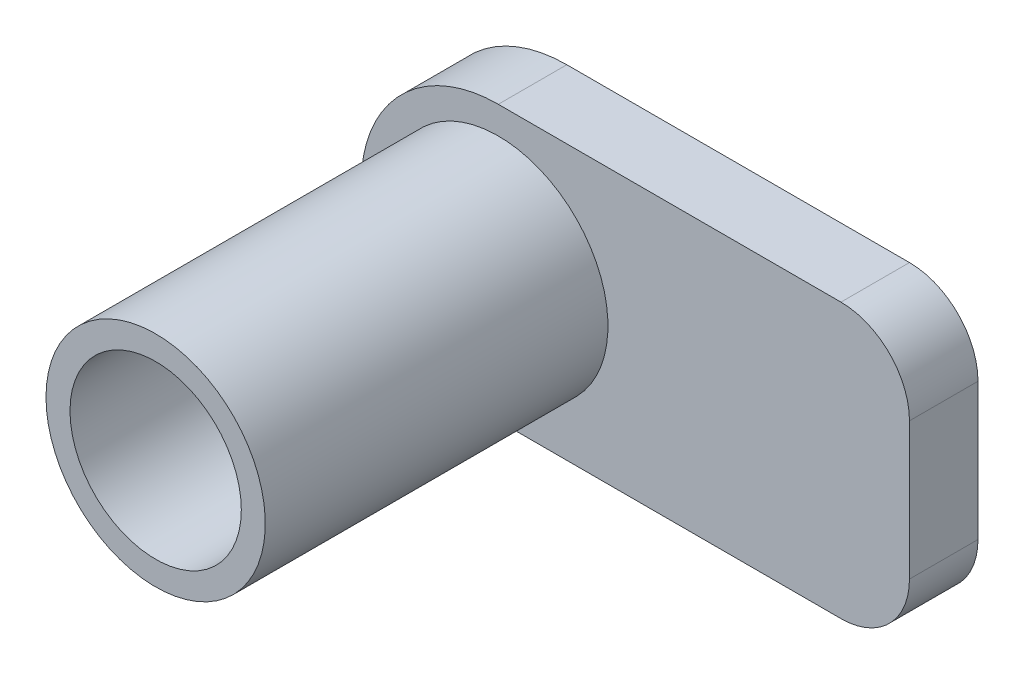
ISO-10303-21;
HEADER;
FILE_DESCRIPTION(('STEP AP214'),'2;1');
FILE_NAME('part.step','',(''),(''),'','','');
FILE_SCHEMA(('AUTOMOTIVE_DESIGN { 1 0 10303 214 1 1 1 1 }'));
ENDSEC;
DATA;
#1=APPLICATION_CONTEXT('core data for automotive mechanical design processes');
#2=APPLICATION_PROTOCOL_DEFINITION('international standard','automotive_design',2000,#1);
#3=PRODUCT_CONTEXT('',#1,'mechanical');
#4=PRODUCT('Part','Part','',(#3));
#5=PRODUCT_RELATED_PRODUCT_CATEGORY('part','',(#4));
#6=PRODUCT_DEFINITION_FORMATION('','',#4);
#7=PRODUCT_DEFINITION_CONTEXT('part definition',#1,'design');
#8=PRODUCT_DEFINITION('design','',#6,#7);
#9=PRODUCT_DEFINITION_SHAPE('','',#8);
#10=(LENGTH_UNIT() NAMED_UNIT(*) SI_UNIT(.MILLI.,.METRE.));
#11=(NAMED_UNIT(*) PLANE_ANGLE_UNIT() SI_UNIT($,.RADIAN.));
#12=(NAMED_UNIT(*) SI_UNIT($,.STERADIAN.) SOLID_ANGLE_UNIT());
#13=UNCERTAINTY_MEASURE_WITH_UNIT(LENGTH_MEASURE(1.E-05),#10,'distance_accuracy_value','');
#14=(GEOMETRIC_REPRESENTATION_CONTEXT(3) GLOBAL_UNCERTAINTY_ASSIGNED_CONTEXT((#13)) GLOBAL_UNIT_ASSIGNED_CONTEXT((#10,
#11,#12)) REPRESENTATION_CONTEXT('',''));
#15=CARTESIAN_POINT('',(0.,0.,0.));
#16=DIRECTION('',(0.,0.,1.));
#17=DIRECTION('',(1.,0.,0.));
#18=AXIS2_PLACEMENT_3D('',#15,#16,#17);
#19=CARTESIAN_POINT('',(-2032.,-270.565217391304,254.));
#20=DIRECTION('',(0.,0.,-1.));
#21=DIRECTION('',(-1.,0.,0.));
#22=AXIS2_PLACEMENT_3D('',#19,#20,#21);
#23=CYLINDRICAL_SURFACE('',#22,254.);
#24=CARTESIAN_POINT('',(-2032.,-270.565217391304,0.));
#25=DIRECTION('',(0.,0.,1.));
#26=DIRECTION('',(1.,0.,0.));
#27=AXIS2_PLACEMENT_3D('',#24,#25,#26);
#28=CIRCLE('',#27,254.);
#29=CARTESIAN_POINT('',(-1778.,-270.565217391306,0.));
#30=VERTEX_POINT('',#29);
#31=CARTESIAN_POINT('',(-2032.,-16.5652173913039,0.));
#32=VERTEX_POINT('',#31);
#33=EDGE_CURVE('E117',#30,#32,#28,.T.);
#34=ORIENTED_EDGE('',*,*,#33,.T.);
#35=DIRECTION('',(0.,0.,-1.));
#36=VECTOR('',#35,1.);
#37=CARTESIAN_POINT('',(-2032.,-16.5652173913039,254.));
#38=LINE('',#37,#36);
#39=CARTESIAN_POINT('',(-2032.,-16.5652173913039,254.));
#40=VERTEX_POINT('',#39);
#41=EDGE_CURVE('E11',#40,#32,#38,.T.);
#42=ORIENTED_EDGE('',*,*,#41,.F.);
#43=CARTESIAN_POINT('',(-2032.,-270.565217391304,254.));
#44=DIRECTION('',(0.,0.,1.));
#45=DIRECTION('',(1.,0.,0.));
#46=AXIS2_PLACEMENT_3D('',#43,#44,#45);
#47=CIRCLE('',#46,254.);
#48=CARTESIAN_POINT('',(-1778.,-270.565217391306,254.));
#49=VERTEX_POINT('',#48);
#50=EDGE_CURVE('E128',#49,#40,#47,.T.);
#51=ORIENTED_EDGE('',*,*,#50,.F.);
#52=DIRECTION('',(0.,0.,-1.));
#53=VECTOR('',#52,1.);
#54=CARTESIAN_POINT('',(-1778.,-270.565217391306,254.));
#55=LINE('',#54,#53);
#56=EDGE_CURVE('E113',#49,#30,#55,.T.);
#57=ORIENTED_EDGE('',*,*,#56,.T.);
#58=EDGE_LOOP('',(#34,#42,#51,#57));
#59=FACE_BOUND('',#58,.T.);
#60=ADVANCED_FACE('F33',(#59),#23,.T.);
#61=CARTESIAN_POINT('',(-3302.,-16.5652173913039,254.));
#62=DIRECTION('',(0.,-1.,0.));
#63=DIRECTION('',(0.,0.,-1.));
#64=AXIS2_PLACEMENT_3D('',#61,#62,#63);
#65=PLANE('',#64);
#66=DIRECTION('',(-1.,0.,0.));
#67=VECTOR('',#66,1.);
#68=CARTESIAN_POINT('',(-3302.,-16.5652173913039,0.));
#69=LINE('',#68,#67);
#70=CARTESIAN_POINT('',(-3302.,-16.565217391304,0.));
#71=VERTEX_POINT('',#70);
#72=EDGE_CURVE('E120',#32,#71,#69,.T.);
#73=ORIENTED_EDGE('',*,*,#72,.T.);
#74=DIRECTION('',(0.,0.,-1.));
#75=VECTOR('',#74,1.);
#76=CARTESIAN_POINT('',(-3302.,-16.565217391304,254.));
#77=LINE('',#76,#75);
#78=CARTESIAN_POINT('',(-3302.,-16.565217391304,254.));
#79=VERTEX_POINT('',#78);
#80=EDGE_CURVE('E41',#79,#71,#77,.T.);
#81=ORIENTED_EDGE('',*,*,#80,.F.);
#82=DIRECTION('',(-1.,0.,0.));
#83=VECTOR('',#82,1.);
#84=CARTESIAN_POINT('',(-3302.,-16.5652173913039,254.));
#85=LINE('',#84,#83);
#86=EDGE_CURVE('E86',#40,#79,#85,.T.);
#87=ORIENTED_EDGE('',*,*,#86,.F.);
#88=ORIENTED_EDGE('',*,*,#41,.T.);
#89=EDGE_LOOP('',(#73,#81,#87,#88));
#90=FACE_BOUND('',#89,.T.);
#91=ADVANCED_FACE('F153',(#90),#65,.F.);
#92=CARTESIAN_POINT('',(-3302.,-524.565217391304,254.));
#93=DIRECTION('',(0.,0.,-1.));
#94=DIRECTION('',(-1.,0.,0.));
#95=AXIS2_PLACEMENT_3D('',#92,#93,#94);
#96=CYLINDRICAL_SURFACE('',#95,508.);
#97=CARTESIAN_POINT('',(-3302.,-524.565217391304,0.));
#98=DIRECTION('',(0.,0.,1.));
#99=DIRECTION('',(-1.,0.,0.));
#100=AXIS2_PLACEMENT_3D('',#97,#98,#99);
#101=CIRCLE('',#100,508.);
#102=CARTESIAN_POINT('',(-3302.,-1032.5652173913,0.));
#103=VERTEX_POINT('',#102);
#104=EDGE_CURVE('E123',#71,#103,#101,.T.);
#105=ORIENTED_EDGE('',*,*,#104,.T.);
#106=DIRECTION('',(0.,0.,-1.));
#107=VECTOR('',#106,1.);
#108=CARTESIAN_POINT('',(-3302.,-1032.5652173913,254.));
#109=LINE('',#108,#107);
#110=CARTESIAN_POINT('',(-3302.,-1032.5652173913,254.));
#111=VERTEX_POINT('',#110);
#112=EDGE_CURVE('E108',#111,#103,#109,.T.);
#113=ORIENTED_EDGE('',*,*,#112,.F.);
#114=CARTESIAN_POINT('',(-3302.,-524.565217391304,254.));
#115=DIRECTION('',(0.,0.,1.));
#116=DIRECTION('',(-1.,0.,0.));
#117=AXIS2_PLACEMENT_3D('',#114,#115,#116);
#118=CIRCLE('',#117,508.);
#119=EDGE_CURVE('E99',#79,#111,#118,.T.);
#120=ORIENTED_EDGE('',*,*,#119,.F.);
#121=ORIENTED_EDGE('',*,*,#80,.T.);
#122=EDGE_LOOP('',(#105,#113,#120,#121));
#123=FACE_BOUND('',#122,.T.);
#124=ADVANCED_FACE('F134',(#123),#96,.T.);
#125=CARTESIAN_POINT('',(-3302.,-1032.5652173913,254.));
#126=DIRECTION('',(0.,1.,0.));
#127=DIRECTION('',(0.,0.,1.));
#128=AXIS2_PLACEMENT_3D('',#125,#126,#127);
#129=PLANE('',#128);
#130=DIRECTION('',(1.,0.,0.));
#131=VECTOR('',#130,1.);
#132=CARTESIAN_POINT('',(-3302.,-1032.5652173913,0.));
#133=LINE('',#132,#131);
#134=CARTESIAN_POINT('',(-2032.,-1032.5652173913,0.));
#135=VERTEX_POINT('',#134);
#136=EDGE_CURVE('E107',#103,#135,#133,.T.);
#137=ORIENTED_EDGE('',*,*,#136,.T.);
#138=DIRECTION('',(0.,0.,-1.));
#139=VECTOR('',#138,1.);
#140=CARTESIAN_POINT('',(-2032.,-1032.5652173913,254.));
#141=LINE('',#140,#139);
#142=CARTESIAN_POINT('',(-2032.,-1032.5652173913,254.));
#143=VERTEX_POINT('',#142);
#144=EDGE_CURVE('E104',#143,#135,#141,.T.);
#145=ORIENTED_EDGE('',*,*,#144,.F.);
#146=DIRECTION('',(1.,0.,0.));
#147=VECTOR('',#146,1.);
#148=CARTESIAN_POINT('',(-3302.,-1032.5652173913,254.));
#149=LINE('',#148,#147);
#150=EDGE_CURVE('E93',#111,#143,#149,.T.);
#151=ORIENTED_EDGE('',*,*,#150,.F.);
#152=ORIENTED_EDGE('',*,*,#112,.T.);
#153=EDGE_LOOP('',(#137,#145,#151,#152));
#154=FACE_BOUND('',#153,.T.);
#155=ADVANCED_FACE('F105',(#154),#129,.F.);
#156=CARTESIAN_POINT('',(-2032.,-778.565217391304,254.));
#157=DIRECTION('',(0.,0.,-1.));
#158=DIRECTION('',(-1.,0.,0.));
#159=AXIS2_PLACEMENT_3D('',#156,#157,#158);
#160=CYLINDRICAL_SURFACE('',#159,254.);
#161=CARTESIAN_POINT('',(-2032.,-778.565217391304,0.));
#162=DIRECTION('',(0.,0.,1.));
#163=DIRECTION('',(1.,0.,0.));
#164=AXIS2_PLACEMENT_3D('',#161,#162,#163);
#165=CIRCLE('',#164,254.);
#166=CARTESIAN_POINT('',(-1778.,-778.565217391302,0.));
#167=VERTEX_POINT('',#166);
#168=EDGE_CURVE('E72',#135,#167,#165,.T.);
#169=ORIENTED_EDGE('',*,*,#168,.T.);
#170=DIRECTION('',(0.,0.,-1.));
#171=VECTOR('',#170,1.);
#172=CARTESIAN_POINT('',(-1778.,-778.565217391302,254.));
#173=LINE('',#172,#171);
#174=CARTESIAN_POINT('',(-1778.,-778.565217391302,254.));
#175=VERTEX_POINT('',#174);
#176=EDGE_CURVE('E109',#175,#167,#173,.T.);
#177=ORIENTED_EDGE('',*,*,#176,.F.);
#178=CARTESIAN_POINT('',(-2032.,-778.565217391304,254.));
#179=DIRECTION('',(0.,0.,1.));
#180=DIRECTION('',(1.,0.,0.));
#181=AXIS2_PLACEMENT_3D('',#178,#179,#180);
#182=CIRCLE('',#181,254.);
#183=EDGE_CURVE('E97',#143,#175,#182,.T.);
#184=ORIENTED_EDGE('',*,*,#183,.F.);
#185=ORIENTED_EDGE('',*,*,#144,.T.);
#186=EDGE_LOOP('',(#169,#177,#184,#185));
#187=FACE_BOUND('',#186,.T.);
#188=ADVANCED_FACE('F111',(#187),#160,.T.);
#189=CARTESIAN_POINT('',(-1778.,-778.565217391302,254.));
#190=DIRECTION('',(-1.,0.,0.));
#191=DIRECTION('',(0.,0.,1.));
#192=AXIS2_PLACEMENT_3D('',#189,#190,#191);
#193=PLANE('',#192);
#194=DIRECTION('',(0.,1.,0.));
#195=VECTOR('',#194,1.);
#196=CARTESIAN_POINT('',(-1778.,-778.565217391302,0.));
#197=LINE('',#196,#195);
#198=EDGE_CURVE('E78',#167,#30,#197,.T.);
#199=ORIENTED_EDGE('',*,*,#198,.T.);
#200=ORIENTED_EDGE('',*,*,#56,.F.);
#201=DIRECTION('',(0.,1.,0.));
#202=VECTOR('',#201,1.);
#203=CARTESIAN_POINT('',(-1778.,-778.565217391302,254.));
#204=LINE('',#203,#202);
#205=EDGE_CURVE('E49',#175,#49,#204,.T.);
#206=ORIENTED_EDGE('',*,*,#205,.F.);
#207=ORIENTED_EDGE('',*,*,#176,.T.);
#208=EDGE_LOOP('',(#199,#200,#206,#207));
#209=FACE_BOUND('',#208,.T.);
#210=ADVANCED_FACE('F141',(#209),#193,.F.);
#211=CARTESIAN_POINT('',(-2032.,-270.565217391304,254.));
#212=DIRECTION('',(0.,0.,1.));
#213=DIRECTION('',(1.,0.,0.));
#214=AXIS2_PLACEMENT_3D('',#211,#212,#213);
#215=PLANE('',#214);
#216=CARTESIAN_POINT('',(-3302.,-524.565217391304,254.));
#217=DIRECTION('',(0.,0.,1.));
#218=DIRECTION('',(1.,0.,0.));
#219=AXIS2_PLACEMENT_3D('',#216,#217,#218);
#220=CIRCLE('',#219,406.4);
#221=CARTESIAN_POINT('',(-3708.4,-524.565217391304,254.));
#222=VERTEX_POINT('',#221);
#223=EDGE_CURVE('E235',#222,#222,#220,.T.);
#224=ORIENTED_EDGE('',*,*,#223,.F.);
#225=EDGE_LOOP('',(#224));
#226=FACE_BOUND('',#225,.T.);
#227=ORIENTED_EDGE('',*,*,#50,.T.);
#228=ORIENTED_EDGE('',*,*,#86,.T.);
#229=ORIENTED_EDGE('',*,*,#119,.T.);
#230=ORIENTED_EDGE('',*,*,#150,.T.);
#231=ORIENTED_EDGE('',*,*,#183,.T.);
#232=ORIENTED_EDGE('',*,*,#205,.T.);
#233=EDGE_LOOP('',(#227,#228,#229,#230,#231,#232));
#234=FACE_BOUND('',#233,.T.);
#235=ADVANCED_FACE('F95',(#226,#234),#215,.T.);
#236=CARTESIAN_POINT('',(-2032.,-270.565217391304,0.));
#237=DIRECTION('',(0.,0.,1.));
#238=DIRECTION('',(1.,0.,0.));
#239=AXIS2_PLACEMENT_3D('',#236,#237,#238);
#240=PLANE('',#239);
#241=ORIENTED_EDGE('',*,*,#33,.F.);
#242=ORIENTED_EDGE('',*,*,#198,.F.);
#243=ORIENTED_EDGE('',*,*,#168,.F.);
#244=ORIENTED_EDGE('',*,*,#136,.F.);
#245=ORIENTED_EDGE('',*,*,#104,.F.);
#246=ORIENTED_EDGE('',*,*,#72,.F.);
#247=EDGE_LOOP('',(#241,#242,#243,#244,#245,#246));
#248=FACE_BOUND('',#247,.T.);
#249=ADVANCED_FACE('F137',(#248),#240,.F.);
#250=CARTESIAN_POINT('',(-3302.,-524.565217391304,1524.));
#251=DIRECTION('',(0.,0.,-1.));
#252=DIRECTION('',(-1.,0.,0.));
#253=AXIS2_PLACEMENT_3D('',#250,#251,#252);
#254=CYLINDRICAL_SURFACE('',#253,406.4);
#255=CARTESIAN_POINT('',(-3302.,-524.565217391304,1524.));
#256=DIRECTION('',(0.,0.,1.));
#257=DIRECTION('',(1.,0.,0.));
#258=AXIS2_PLACEMENT_3D('',#255,#256,#257);
#259=CIRCLE('',#258,406.4);
#260=CARTESIAN_POINT('',(-3708.4,-524.565217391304,1524.));
#261=VERTEX_POINT('',#260);
#262=EDGE_CURVE('E121',#261,#261,#259,.T.);
#263=CARTESIAN_POINT('',(-3708.4,-524.565217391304,1524.));
#264=CARTESIAN_POINT('',(-3708.4,-524.565217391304,1510.77083333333));
#265=CARTESIAN_POINT('',(-3708.4,-524.565217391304,1497.54166666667));
#266=CARTESIAN_POINT('',(-3708.4,-524.565217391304,1471.08333333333));
#267=CARTESIAN_POINT('',(-3708.4,-524.565217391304,1457.85416666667));
#268=CARTESIAN_POINT('',(-3708.4,-524.565217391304,1431.39583333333));
#269=CARTESIAN_POINT('',(-3708.4,-524.565217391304,1418.16666666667));
#270=CARTESIAN_POINT('',(-3708.4,-524.565217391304,1391.70833333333));
#271=CARTESIAN_POINT('',(-3708.4,-524.565217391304,1378.47916666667));
#272=CARTESIAN_POINT('',(-3708.4,-524.565217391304,1352.02083333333));
#273=CARTESIAN_POINT('',(-3708.4,-524.565217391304,1338.79166666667));
#274=CARTESIAN_POINT('',(-3708.4,-524.565217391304,1312.33333333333));
#275=CARTESIAN_POINT('',(-3708.4,-524.565217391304,1299.10416666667));
#276=CARTESIAN_POINT('',(-3708.4,-524.565217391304,1272.64583333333));
#277=CARTESIAN_POINT('',(-3708.4,-524.565217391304,1259.41666666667));
#278=CARTESIAN_POINT('',(-3708.4,-524.565217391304,1232.95833333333));
#279=CARTESIAN_POINT('',(-3708.4,-524.565217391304,1219.72916666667));
#280=CARTESIAN_POINT('',(-3708.4,-524.565217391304,1193.27083333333));
#281=CARTESIAN_POINT('',(-3708.4,-524.565217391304,1180.04166666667));
#282=CARTESIAN_POINT('',(-3708.4,-524.565217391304,1153.58333333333));
#283=CARTESIAN_POINT('',(-3708.4,-524.565217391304,1140.35416666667));
#284=CARTESIAN_POINT('',(-3708.4,-524.565217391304,1113.89583333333));
#285=CARTESIAN_POINT('',(-3708.4,-524.565217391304,1100.66666666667));
#286=CARTESIAN_POINT('',(-3708.4,-524.565217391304,1074.20833333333));
#287=CARTESIAN_POINT('',(-3708.4,-524.565217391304,1060.97916666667));
#288=CARTESIAN_POINT('',(-3708.4,-524.565217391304,1034.52083333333));
#289=CARTESIAN_POINT('',(-3708.4,-524.565217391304,1021.29166666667));
#290=CARTESIAN_POINT('',(-3708.4,-524.565217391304,994.833333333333));
#291=CARTESIAN_POINT('',(-3708.4,-524.565217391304,981.604166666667));
#292=CARTESIAN_POINT('',(-3708.4,-524.565217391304,955.145833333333));
#293=CARTESIAN_POINT('',(-3708.4,-524.565217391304,941.916666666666));
#294=CARTESIAN_POINT('',(-3708.4,-524.565217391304,915.458333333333));
#295=CARTESIAN_POINT('',(-3708.4,-524.565217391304,902.229166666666));
#296=CARTESIAN_POINT('',(-3708.4,-524.565217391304,875.770833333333));
#297=CARTESIAN_POINT('',(-3708.4,-524.565217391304,862.541666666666));
#298=CARTESIAN_POINT('',(-3708.4,-524.565217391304,836.083333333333));
#299=CARTESIAN_POINT('',(-3708.4,-524.565217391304,822.854166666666));
#300=CARTESIAN_POINT('',(-3708.4,-524.565217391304,796.395833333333));
#301=CARTESIAN_POINT('',(-3708.4,-524.565217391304,783.166666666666));
#302=CARTESIAN_POINT('',(-3708.4,-524.565217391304,756.708333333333));
#303=CARTESIAN_POINT('',(-3708.4,-524.565217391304,743.479166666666));
#304=CARTESIAN_POINT('',(-3708.4,-524.565217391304,717.020833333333));
#305=CARTESIAN_POINT('',(-3708.4,-524.565217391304,703.791666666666));
#306=CARTESIAN_POINT('',(-3708.4,-524.565217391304,677.333333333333));
#307=CARTESIAN_POINT('',(-3708.4,-524.565217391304,664.104166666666));
#308=CARTESIAN_POINT('',(-3708.4,-524.565217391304,637.645833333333));
#309=CARTESIAN_POINT('',(-3708.4,-524.565217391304,624.416666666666));
#310=CARTESIAN_POINT('',(-3708.4,-524.565217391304,597.958333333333));
#311=CARTESIAN_POINT('',(-3708.4,-524.565217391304,584.729166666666));
#312=CARTESIAN_POINT('',(-3708.4,-524.565217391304,558.270833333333));
#313=CARTESIAN_POINT('',(-3708.4,-524.565217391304,545.041666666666));
#314=CARTESIAN_POINT('',(-3708.4,-524.565217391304,518.583333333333));
#315=CARTESIAN_POINT('',(-3708.4,-524.565217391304,505.354166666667));
#316=CARTESIAN_POINT('',(-3708.4,-524.565217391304,478.895833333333));
#317=CARTESIAN_POINT('',(-3708.4,-524.565217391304,465.666666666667));
#318=CARTESIAN_POINT('',(-3708.4,-524.565217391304,439.208333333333));
#319=CARTESIAN_POINT('',(-3708.4,-524.565217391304,425.979166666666));
#320=CARTESIAN_POINT('',(-3708.4,-524.565217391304,399.520833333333));
#321=CARTESIAN_POINT('',(-3708.4,-524.565217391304,386.291666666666));
#322=CARTESIAN_POINT('',(-3708.4,-524.565217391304,359.833333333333));
#323=CARTESIAN_POINT('',(-3708.4,-524.565217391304,346.604166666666));
#324=CARTESIAN_POINT('',(-3708.4,-524.565217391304,320.145833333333));
#325=CARTESIAN_POINT('',(-3708.4,-524.565217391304,306.916666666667));
#326=CARTESIAN_POINT('',(-3708.4,-524.565217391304,280.458333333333));
#327=CARTESIAN_POINT('',(-3708.4,-524.565217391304,267.229166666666));
#328=CARTESIAN_POINT('',(-3708.4,-524.565217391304,254.));
#329=B_SPLINE_CURVE_WITH_KNOTS('',3,(#263,#264,#265,#266,#267,#268,#269,#270,#271,#272,#273,
#274,#275,#276,#277,#278,#279,#280,#281,#282,#283,#284,#285,#286,#287,#288,#289,#290,#291,#292,
#293,#294,#295,#296,#297,#298,#299,#300,#301,#302,#303,#304,#305,#306,#307,#308,#309,#310,#311,
#312,#313,#314,#315,#316,#317,#318,#319,#320,#321,#322,#323,#324,#325,#326,#327,#328),
.UNSPECIFIED.,.F.,.F.,(4,2,2,2,2,2,2,2,2,2,2,2,2,2,2,2,2,2,2,2,2,2,2,2,2,2,2,2,2,2,2,2,4),(0.,
39.6875000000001,79.3750000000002,119.0625,158.75,198.4375,238.125,277.8125,317.5,357.1875,
396.875,436.5625,476.25,515.9375,555.625,595.3125,635.,674.6875,714.375,754.0625,793.75,
833.4375,873.125,912.8125,952.5,992.1875,1031.875,1071.5625,1111.25,1150.9375,1190.625,
1230.3125,1270.),.UNSPECIFIED.);
#330=EDGE_CURVE('BSEAM185',#261,#222,#329,.T.);
#331=ORIENTED_EDGE('',*,*,#262,.F.);
#332=ORIENTED_EDGE('',*,*,#223,.T.);
#333=ORIENTED_EDGE('',*,*,#330,.T.);
#334=ORIENTED_EDGE('',*,*,#330,.F.);
#335=EDGE_LOOP('',(#331,#333,#332,#334));
#336=FACE_BOUND('',#335,.T.);
#337=ADVANCED_FACE('F185',(#336),#254,.T.);
#338=CARTESIAN_POINT('',(-3302.,-524.565217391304,1524.));
#339=DIRECTION('',(0.,0.,1.));
#340=DIRECTION('',(1.,0.,0.));
#341=AXIS2_PLACEMENT_3D('',#338,#339,#340);
#342=PLANE('',#341);
#343=CARTESIAN_POINT('',(-3302.,-524.565217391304,1524.));
#344=DIRECTION('',(0.,0.,1.));
#345=DIRECTION('',(1.,0.,0.));
#346=AXIS2_PLACEMENT_3D('',#343,#344,#345);
#347=CIRCLE('',#346,317.5);
#348=CARTESIAN_POINT('',(-2984.5,-524.565217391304,1524.));
#349=VERTEX_POINT('',#348);
#350=EDGE_CURVE('E236',#349,#349,#347,.T.);
#351=ORIENTED_EDGE('',*,*,#350,.F.);
#352=EDGE_LOOP('',(#351));
#353=FACE_BOUND('',#352,.T.);
#354=ORIENTED_EDGE('',*,*,#262,.T.);
#355=EDGE_LOOP('',(#354));
#356=FACE_BOUND('',#355,.T.);
#357=ADVANCED_FACE('F198',(#353,#356),#342,.T.);
#358=CARTESIAN_POINT('',(-3302.,-524.565217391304,762.));
#359=DIRECTION('',(0.,0.,1.));
#360=DIRECTION('',(1.,0.,0.));
#361=AXIS2_PLACEMENT_3D('',#358,#359,#360);
#362=CYLINDRICAL_SURFACE('',#361,317.5);
#363=CARTESIAN_POINT('',(-3302.,-524.565217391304,762.));
#364=DIRECTION('',(0.,0.,1.));
#365=DIRECTION('',(1.,0.,0.));
#366=AXIS2_PLACEMENT_3D('',#363,#364,#365);
#367=CIRCLE('',#366,317.5);
#368=CARTESIAN_POINT('',(-2984.5,-524.565217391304,762.));
#369=VERTEX_POINT('',#368);
#370=EDGE_CURVE('E234',#369,#369,#367,.T.);
#371=ORIENTED_EDGE('',*,*,#370,.F.);
#372=EDGE_LOOP('',(#371));
#373=FACE_BOUND('',#372,.T.);
#374=ORIENTED_EDGE('',*,*,#350,.T.);
#375=EDGE_LOOP('',(#374));
#376=FACE_BOUND('',#375,.T.);
#377=ADVANCED_FACE('F208',(#373,#376),#362,.F.);
#378=CARTESIAN_POINT('',(-3302.,-524.565217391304,762.));
#379=DIRECTION('',(0.,0.,1.));
#380=DIRECTION('',(1.,0.,0.));
#381=AXIS2_PLACEMENT_3D('',#378,#379,#380);
#382=PLANE('',#381);
#383=ORIENTED_EDGE('',*,*,#370,.T.);
#384=EDGE_LOOP('',(#383));
#385=FACE_BOUND('',#384,.T.);
#386=ADVANCED_FACE('F218',(#385),#382,.T.);
#387=CLOSED_SHELL('',(#60,#91,#124,#155,#188,#210,#235,#249,#337,#357,#377,#386));
#388=MANIFOLD_SOLID_BREP('B2',#387);
#389=ADVANCED_BREP_SHAPE_REPRESENTATION('',(#18,#388),#14);
#390=SHAPE_DEFINITION_REPRESENTATION(#9,#389);
ENDSEC;
END-ISO-10303-21;
